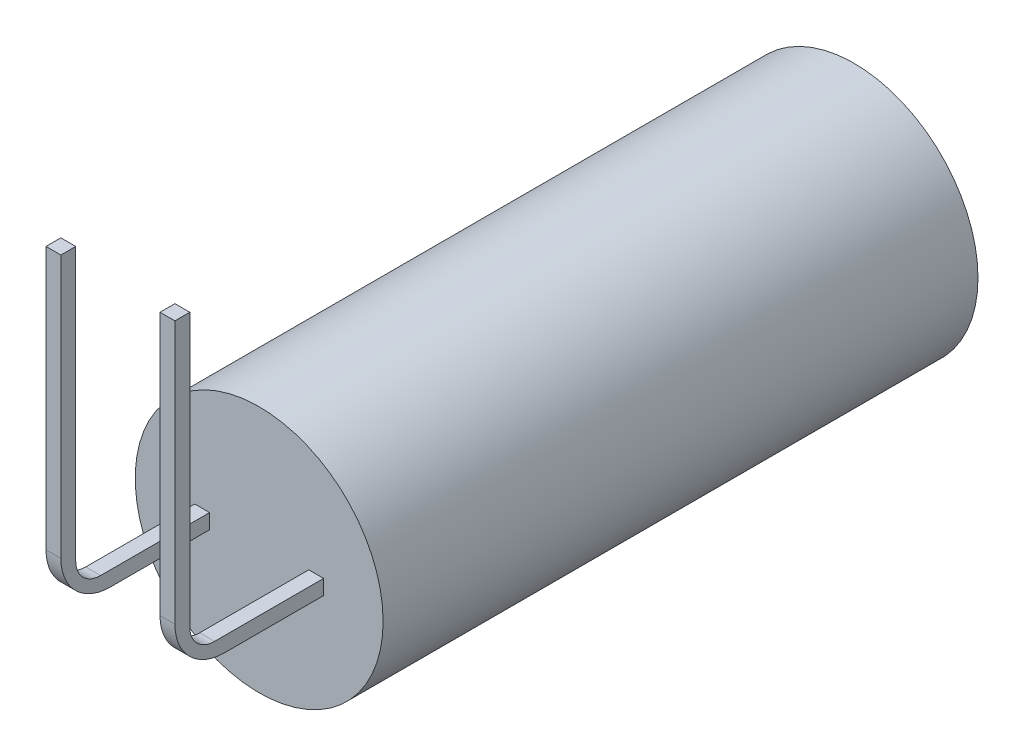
ISO-10303-21;
HEADER;
FILE_DESCRIPTION(('STEP AP214'),'2;1');
FILE_NAME('part.step','',(''),(''),'','','');
FILE_SCHEMA(('AUTOMOTIVE_DESIGN { 1 0 10303 214 1 1 1 1 }'));
ENDSEC;
DATA;
#1=APPLICATION_CONTEXT('core data for automotive mechanical design processes');
#2=APPLICATION_PROTOCOL_DEFINITION('international standard','automotive_design',2000,#1);
#3=PRODUCT_CONTEXT('',#1,'mechanical');
#4=PRODUCT('Part','Part','',(#3));
#5=PRODUCT_RELATED_PRODUCT_CATEGORY('part','',(#4));
#6=PRODUCT_DEFINITION_FORMATION('','',#4);
#7=PRODUCT_DEFINITION_CONTEXT('part definition',#1,'design');
#8=PRODUCT_DEFINITION('design','',#6,#7);
#9=PRODUCT_DEFINITION_SHAPE('','',#8);
#10=(LENGTH_UNIT() NAMED_UNIT(*) SI_UNIT(.MILLI.,.METRE.));
#11=(NAMED_UNIT(*) PLANE_ANGLE_UNIT() SI_UNIT($,.RADIAN.));
#12=(NAMED_UNIT(*) SI_UNIT($,.STERADIAN.) SOLID_ANGLE_UNIT());
#13=UNCERTAINTY_MEASURE_WITH_UNIT(LENGTH_MEASURE(1.E-05),#10,'distance_accuracy_value','');
#14=(GEOMETRIC_REPRESENTATION_CONTEXT(3) GLOBAL_UNCERTAINTY_ASSIGNED_CONTEXT((#13)) GLOBAL_UNIT_ASSIGNED_CONTEXT((#10,
#11,#12)) REPRESENTATION_CONTEXT('',''));
#15=CARTESIAN_POINT('',(0.,0.,0.));
#16=DIRECTION('',(0.,0.,1.));
#17=DIRECTION('',(1.,0.,0.));
#18=AXIS2_PLACEMENT_3D('',#15,#16,#17);
#19=CARTESIAN_POINT('',(1.3,0.15,3.));
#20=DIRECTION('',(0.,-1.,0.));
#21=DIRECTION('',(1.,0.,0.));
#22=AXIS2_PLACEMENT_3D('',#19,#20,#21);
#23=PLANE('',#22);
#24=DIRECTION('',(0.,0.,-1.));
#25=VECTOR('',#24,1.);
#26=CARTESIAN_POINT('',(1.,0.15,3.));
#27=LINE('',#26,#25);
#28=CARTESIAN_POINT('',(1.,0.15,2.2));
#29=VERTEX_POINT('',#28);
#30=CARTESIAN_POINT('',(1.,0.15,0.));
#31=VERTEX_POINT('',#30);
#32=EDGE_CURVE('E209',#29,#31,#27,.T.);
#33=ORIENTED_EDGE('',*,*,#32,.F.);
#34=DIRECTION('',(-1.,0.,0.));
#35=VECTOR('',#34,1.);
#36=CARTESIAN_POINT('',(1.3,0.15,2.2));
#37=LINE('',#36,#35);
#38=CARTESIAN_POINT('',(1.3,0.15,2.2));
#39=VERTEX_POINT('',#38);
#40=EDGE_CURVE('E245',#29,#39,#37,.F.);
#41=ORIENTED_EDGE('',*,*,#40,.T.);
#42=DIRECTION('',(0.,0.,-1.));
#43=VECTOR('',#42,1.);
#44=CARTESIAN_POINT('',(1.3,0.15,3.));
#45=LINE('',#44,#43);
#46=CARTESIAN_POINT('',(1.3,0.15,0.));
#47=VERTEX_POINT('',#46);
#48=EDGE_CURVE('E203',#39,#47,#45,.T.);
#49=ORIENTED_EDGE('',*,*,#48,.T.);
#50=DIRECTION('',(-1.,0.,0.));
#51=VECTOR('',#50,1.);
#52=CARTESIAN_POINT('',(1.3,0.15,0.));
#53=LINE('',#52,#51);
#54=EDGE_CURVE('E191',#47,#31,#53,.T.);
#55=ORIENTED_EDGE('',*,*,#54,.T.);
#56=EDGE_LOOP('',(#33,#41,#49,#55));
#57=FACE_BOUND('',#56,.T.);
#58=ADVANCED_FACE('F31',(#57),#23,.F.);
#59=CARTESIAN_POINT('',(-1.3,0.15,3.));
#60=DIRECTION('',(0.,-1.,0.));
#61=DIRECTION('',(0.,0.,-1.));
#62=AXIS2_PLACEMENT_3D('',#59,#60,#61);
#63=PLANE('',#62);
#64=DIRECTION('',(0.,0.,-1.));
#65=VECTOR('',#64,1.);
#66=CARTESIAN_POINT('',(-1.3,0.15,3.));
#67=LINE('',#66,#65);
#68=CARTESIAN_POINT('',(-1.3,0.15,2.2));
#69=VERTEX_POINT('',#68);
#70=CARTESIAN_POINT('',(-1.3,0.15,0.));
#71=VERTEX_POINT('',#70);
#72=EDGE_CURVE('E228',#69,#71,#67,.T.);
#73=ORIENTED_EDGE('',*,*,#72,.F.);
#74=DIRECTION('',(-1.,0.,0.));
#75=VECTOR('',#74,1.);
#76=CARTESIAN_POINT('',(-1.,0.15,2.2));
#77=LINE('',#76,#75);
#78=CARTESIAN_POINT('',(-1.,0.15,2.2));
#79=VERTEX_POINT('',#78);
#80=EDGE_CURVE('E250',#69,#79,#77,.F.);
#81=ORIENTED_EDGE('',*,*,#80,.T.);
#82=DIRECTION('',(0.,0.,-1.));
#83=VECTOR('',#82,1.);
#84=CARTESIAN_POINT('',(-1.,0.15,3.));
#85=LINE('',#84,#83);
#86=CARTESIAN_POINT('',(-1.,0.15,0.));
#87=VERTEX_POINT('',#86);
#88=EDGE_CURVE('E230',#79,#87,#85,.T.);
#89=ORIENTED_EDGE('',*,*,#88,.T.);
#90=DIRECTION('',(-1.,0.,0.));
#91=VECTOR('',#90,1.);
#92=CARTESIAN_POINT('',(-1.3,0.15,0.));
#93=LINE('',#92,#91);
#94=EDGE_CURVE('E220',#87,#71,#93,.T.);
#95=ORIENTED_EDGE('',*,*,#94,.T.);
#96=EDGE_LOOP('',(#73,#81,#89,#95));
#97=FACE_BOUND('',#96,.T.);
#98=ADVANCED_FACE('F298',(#97),#63,.F.);
#99=CARTESIAN_POINT('',(0.,0.,0.));
#100=DIRECTION('',(0.,0.,1.));
#101=DIRECTION('',(1.,0.,0.));
#102=AXIS2_PLACEMENT_3D('',#99,#100,#101);
#103=PLANE('',#102);
#104=DIRECTION('',(1.,0.,0.));
#105=VECTOR('',#104,1.);
#106=CARTESIAN_POINT('',(-1.3,-0.15,0.));
#107=LINE('',#106,#105);
#108=CARTESIAN_POINT('',(-1.3,-0.15,0.));
#109=VERTEX_POINT('',#108);
#110=CARTESIAN_POINT('',(-1.,-0.15,0.));
#111=VERTEX_POINT('',#110);
#112=EDGE_CURVE('E214',#109,#111,#107,.T.);
#113=ORIENTED_EDGE('',*,*,#112,.F.);
#114=DIRECTION('',(0.,-1.,0.));
#115=VECTOR('',#114,1.);
#116=CARTESIAN_POINT('',(-1.3,0.15,0.));
#117=LINE('',#116,#115);
#118=EDGE_CURVE('E211',#71,#109,#117,.T.);
#119=ORIENTED_EDGE('',*,*,#118,.F.);
#120=ORIENTED_EDGE('',*,*,#94,.F.);
#121=DIRECTION('',(0.,1.,0.));
#122=VECTOR('',#121,1.);
#123=CARTESIAN_POINT('',(-1.,0.15,0.));
#124=LINE('',#123,#122);
#125=EDGE_CURVE('E217',#111,#87,#124,.T.);
#126=ORIENTED_EDGE('',*,*,#125,.F.);
#127=EDGE_LOOP('',(#113,#119,#120,#126));
#128=FACE_BOUND('',#127,.T.);
#129=CARTESIAN_POINT('',(0.,0.,0.));
#130=DIRECTION('',(0.,0.,1.));
#131=DIRECTION('',(1.,0.,0.));
#132=AXIS2_PLACEMENT_3D('',#129,#130,#131);
#133=CIRCLE('',#132,2.5);
#134=CARTESIAN_POINT('',(2.5,0.,0.));
#135=VERTEX_POINT('',#134);
#136=EDGE_CURVE('E236',#135,#135,#133,.T.);
#137=ORIENTED_EDGE('',*,*,#136,.T.);
#138=EDGE_LOOP('',(#137));
#139=FACE_BOUND('',#138,.T.);
#140=DIRECTION('',(0.,-1.,0.));
#141=VECTOR('',#140,1.);
#142=CARTESIAN_POINT('',(1.,0.15,0.));
#143=LINE('',#142,#141);
#144=CARTESIAN_POINT('',(1.,-0.15,0.));
#145=VERTEX_POINT('',#144);
#146=EDGE_CURVE('E194',#31,#145,#143,.T.);
#147=ORIENTED_EDGE('',*,*,#146,.F.);
#148=ORIENTED_EDGE('',*,*,#54,.F.);
#149=DIRECTION('',(0.,1.,0.));
#150=VECTOR('',#149,1.);
#151=CARTESIAN_POINT('',(1.3,0.15,0.));
#152=LINE('',#151,#150);
#153=CARTESIAN_POINT('',(1.3,-0.15,0.));
#154=VERTEX_POINT('',#153);
#155=EDGE_CURVE('E153',#154,#47,#152,.T.);
#156=ORIENTED_EDGE('',*,*,#155,.F.);
#157=DIRECTION('',(1.,0.,0.));
#158=VECTOR('',#157,1.);
#159=CARTESIAN_POINT('',(1.3,-0.15,0.));
#160=LINE('',#159,#158);
#161=EDGE_CURVE('E197',#145,#154,#160,.T.);
#162=ORIENTED_EDGE('',*,*,#161,.F.);
#163=EDGE_LOOP('',(#147,#148,#156,#162));
#164=FACE_BOUND('',#163,.T.);
#165=ADVANCED_FACE('F303',(#128,#139,#164),#103,.T.);
#166=CARTESIAN_POINT('',(0.,0.,-12.));
#167=DIRECTION('',(0.,0.,1.));
#168=DIRECTION('',(1.,0.,0.));
#169=AXIS2_PLACEMENT_3D('',#166,#167,#168);
#170=CYLINDRICAL_SURFACE('',#169,2.5);
#171=CARTESIAN_POINT('',(0.,0.,-12.));
#172=DIRECTION('',(0.,0.,1.));
#173=DIRECTION('',(1.,0.,0.));
#174=AXIS2_PLACEMENT_3D('',#171,#172,#173);
#175=CIRCLE('',#174,2.5);
#176=CARTESIAN_POINT('',(2.5,0.,-12.));
#177=VERTEX_POINT('',#176);
#178=EDGE_CURVE('E239',#177,#177,#175,.T.);
#179=ORIENTED_EDGE('',*,*,#178,.T.);
#180=EDGE_LOOP('',(#179));
#181=FACE_BOUND('',#180,.T.);
#182=ORIENTED_EDGE('',*,*,#136,.F.);
#183=EDGE_LOOP('',(#182));
#184=FACE_BOUND('',#183,.T.);
#185=ADVANCED_FACE('F33',(#181,#184),#170,.T.);
#186=CARTESIAN_POINT('',(0.,0.,-12.));
#187=DIRECTION('',(0.,0.,1.));
#188=DIRECTION('',(1.,0.,0.));
#189=AXIS2_PLACEMENT_3D('',#186,#187,#188);
#190=PLANE('',#189);
#191=ORIENTED_EDGE('',*,*,#178,.F.);
#192=EDGE_LOOP('',(#191));
#193=FACE_BOUND('',#192,.T.);
#194=ADVANCED_FACE('F324',(#193),#190,.F.);
#195=CARTESIAN_POINT('',(-1.3,0.15,3.));
#196=DIRECTION('',(1.,0.,0.));
#197=DIRECTION('',(0.,0.,-1.));
#198=AXIS2_PLACEMENT_3D('',#195,#196,#197);
#199=PLANE('',#198);
#200=DIRECTION('',(0.,0.,-1.));
#201=VECTOR('',#200,1.);
#202=CARTESIAN_POINT('',(-1.3,-0.15,3.));
#203=LINE('',#202,#201);
#204=CARTESIAN_POINT('',(-1.3,-0.15,2.));
#205=VERTEX_POINT('',#204);
#206=EDGE_CURVE('E234',#205,#109,#203,.T.);
#207=ORIENTED_EDGE('',*,*,#206,.F.);
#208=CARTESIAN_POINT('',(-1.3,0.85,2.));
#209=DIRECTION('',(1.,0.,0.));
#210=DIRECTION('',(0.,0.,-1.));
#211=AXIS2_PLACEMENT_3D('',#208,#209,#210);
#212=CIRCLE('',#211,1.);
#213=CARTESIAN_POINT('',(-1.3,0.85,3.));
#214=VERTEX_POINT('',#213);
#215=EDGE_CURVE('E267',#205,#214,#212,.F.);
#216=ORIENTED_EDGE('',*,*,#215,.T.);
#217=DIRECTION('',(0.,-1.,0.));
#218=VECTOR('',#217,1.);
#219=CARTESIAN_POINT('',(-1.3,0.15,3.));
#220=LINE('',#219,#218);
#221=CARTESIAN_POINT('',(-1.3,6.15,3.));
#222=VERTEX_POINT('',#221);
#223=EDGE_CURVE('E223',#222,#214,#220,.T.);
#224=ORIENTED_EDGE('',*,*,#223,.F.);
#225=DIRECTION('',(0.,0.,1.));
#226=VECTOR('',#225,1.);
#227=CARTESIAN_POINT('',(-1.3,6.15,3.));
#228=LINE('',#227,#226);
#229=CARTESIAN_POINT('',(-1.3,6.15,2.7));
#230=VERTEX_POINT('',#229);
#231=EDGE_CURVE('E175',#230,#222,#228,.T.);
#232=ORIENTED_EDGE('',*,*,#231,.F.);
#233=DIRECTION('',(0.,-1.,0.));
#234=VECTOR('',#233,1.);
#235=CARTESIAN_POINT('',(-1.3,6.15,2.7));
#236=LINE('',#235,#234);
#237=CARTESIAN_POINT('',(-1.3,0.65,2.7));
#238=VERTEX_POINT('',#237);
#239=EDGE_CURVE('E185',#230,#238,#236,.T.);
#240=ORIENTED_EDGE('',*,*,#239,.T.);
#241=CARTESIAN_POINT('',(-1.3,0.65,2.2));
#242=DIRECTION('',(1.,0.,0.));
#243=DIRECTION('',(0.,0.,-1.));
#244=AXIS2_PLACEMENT_3D('',#241,#242,#243);
#245=CIRCLE('',#244,0.5);
#246=EDGE_CURVE('E256',#238,#69,#245,.T.);
#247=ORIENTED_EDGE('',*,*,#246,.T.);
#248=ORIENTED_EDGE('',*,*,#72,.T.);
#249=ORIENTED_EDGE('',*,*,#118,.T.);
#250=EDGE_LOOP('',(#207,#216,#224,#232,#240,#247,#248,#249));
#251=FACE_BOUND('',#250,.T.);
#252=ADVANCED_FACE('F320',(#251),#199,.F.);
#253=CARTESIAN_POINT('',(-1.3,-0.15,3.));
#254=DIRECTION('',(0.,1.,0.));
#255=DIRECTION('',(0.,0.,1.));
#256=AXIS2_PLACEMENT_3D('',#253,#254,#255);
#257=PLANE('',#256);
#258=DIRECTION('',(0.,0.,-1.));
#259=VECTOR('',#258,1.);
#260=CARTESIAN_POINT('',(-1.,-0.15,3.));
#261=LINE('',#260,#259);
#262=CARTESIAN_POINT('',(-1.,-0.15,2.));
#263=VERTEX_POINT('',#262);
#264=EDGE_CURVE('E232',#263,#111,#261,.T.);
#265=ORIENTED_EDGE('',*,*,#264,.F.);
#266=DIRECTION('',(1.,0.,0.));
#267=VECTOR('',#266,1.);
#268=CARTESIAN_POINT('',(-1.3,-0.15,2.));
#269=LINE('',#268,#267);
#270=EDGE_CURVE('E265',#263,#205,#269,.F.);
#271=ORIENTED_EDGE('',*,*,#270,.T.);
#272=ORIENTED_EDGE('',*,*,#206,.T.);
#273=ORIENTED_EDGE('',*,*,#112,.T.);
#274=EDGE_LOOP('',(#265,#271,#272,#273));
#275=FACE_BOUND('',#274,.T.);
#276=ADVANCED_FACE('F316',(#275),#257,.F.);
#277=CARTESIAN_POINT('',(-1.,0.15,3.));
#278=DIRECTION('',(-1.,0.,0.));
#279=DIRECTION('',(0.,0.,1.));
#280=AXIS2_PLACEMENT_3D('',#277,#278,#279);
#281=PLANE('',#280);
#282=DIRECTION('',(0.,1.,0.));
#283=VECTOR('',#282,1.);
#284=CARTESIAN_POINT('',(-1.,0.15,3.));
#285=LINE('',#284,#283);
#286=CARTESIAN_POINT('',(-1.,0.85,3.));
#287=VERTEX_POINT('',#286);
#288=CARTESIAN_POINT('',(-1.,6.15,3.));
#289=VERTEX_POINT('',#288);
#290=EDGE_CURVE('E226',#287,#289,#285,.T.);
#291=ORIENTED_EDGE('',*,*,#290,.F.);
#292=CARTESIAN_POINT('',(-1.,0.85,2.));
#293=DIRECTION('',(-1.,0.,0.));
#294=DIRECTION('',(0.,0.,1.));
#295=AXIS2_PLACEMENT_3D('',#292,#293,#294);
#296=CIRCLE('',#295,1.);
#297=EDGE_CURVE('E263',#287,#263,#296,.F.);
#298=ORIENTED_EDGE('',*,*,#297,.T.);
#299=ORIENTED_EDGE('',*,*,#264,.T.);
#300=ORIENTED_EDGE('',*,*,#125,.T.);
#301=ORIENTED_EDGE('',*,*,#88,.F.);
#302=CARTESIAN_POINT('',(-1.,0.65,2.2));
#303=DIRECTION('',(-1.,0.,0.));
#304=DIRECTION('',(0.,0.,1.));
#305=AXIS2_PLACEMENT_3D('',#302,#303,#304);
#306=CIRCLE('',#305,0.5);
#307=CARTESIAN_POINT('',(-1.,0.65,2.7));
#308=VERTEX_POINT('',#307);
#309=EDGE_CURVE('E258',#79,#308,#306,.T.);
#310=ORIENTED_EDGE('',*,*,#309,.T.);
#311=DIRECTION('',(0.,-1.,0.));
#312=VECTOR('',#311,1.);
#313=CARTESIAN_POINT('',(-1.,6.15,2.7));
#314=LINE('',#313,#312);
#315=CARTESIAN_POINT('',(-1.,6.15,2.7));
#316=VERTEX_POINT('',#315);
#317=EDGE_CURVE('E188',#316,#308,#314,.T.);
#318=ORIENTED_EDGE('',*,*,#317,.F.);
#319=DIRECTION('',(0.,0.,-1.));
#320=VECTOR('',#319,1.);
#321=CARTESIAN_POINT('',(-1.,6.15,3.));
#322=LINE('',#321,#320);
#323=EDGE_CURVE('E181',#289,#316,#322,.T.);
#324=ORIENTED_EDGE('',*,*,#323,.F.);
#325=EDGE_LOOP('',(#291,#298,#299,#300,#301,#310,#318,#324));
#326=FACE_BOUND('',#325,.T.);
#327=ADVANCED_FACE('F311',(#326),#281,.F.);
#328=CARTESIAN_POINT('',(-1.3,-0.15,3.));
#329=DIRECTION('',(0.,0.,1.));
#330=DIRECTION('',(1.,0.,0.));
#331=AXIS2_PLACEMENT_3D('',#328,#329,#330);
#332=PLANE('',#331);
#333=ORIENTED_EDGE('',*,*,#223,.T.);
#334=DIRECTION('',(1.,0.,0.));
#335=VECTOR('',#334,1.);
#336=CARTESIAN_POINT('',(-1.,0.85,3.));
#337=LINE('',#336,#335);
#338=EDGE_CURVE('E260',#214,#287,#337,.T.);
#339=ORIENTED_EDGE('',*,*,#338,.T.);
#340=ORIENTED_EDGE('',*,*,#290,.T.);
#341=DIRECTION('',(1.,0.,0.));
#342=VECTOR('',#341,1.);
#343=CARTESIAN_POINT('',(-1.3,6.15,3.));
#344=LINE('',#343,#342);
#345=EDGE_CURVE('E178',#222,#289,#344,.T.);
#346=ORIENTED_EDGE('',*,*,#345,.F.);
#347=EDGE_LOOP('',(#333,#339,#340,#346));
#348=FACE_BOUND('',#347,.T.);
#349=ADVANCED_FACE('F309',(#348),#332,.T.);
#350=CARTESIAN_POINT('',(1.,0.15,3.));
#351=DIRECTION('',(1.,0.,0.));
#352=DIRECTION('',(0.,1.,0.));
#353=AXIS2_PLACEMENT_3D('',#350,#351,#352);
#354=PLANE('',#353);
#355=DIRECTION('',(0.,0.,-1.));
#356=VECTOR('',#355,1.);
#357=CARTESIAN_POINT('',(1.,-0.15,3.));
#358=LINE('',#357,#356);
#359=CARTESIAN_POINT('',(1.,-0.15,2.));
#360=VERTEX_POINT('',#359);
#361=EDGE_CURVE('E207',#360,#145,#358,.T.);
#362=ORIENTED_EDGE('',*,*,#361,.F.);
#363=CARTESIAN_POINT('',(0.999999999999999,0.85,2.));
#364=DIRECTION('',(1.,0.,0.));
#365=DIRECTION('',(0.,1.,0.));
#366=AXIS2_PLACEMENT_3D('',#363,#364,#365);
#367=CIRCLE('',#366,1.);
#368=CARTESIAN_POINT('',(0.999999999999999,0.85,3.));
#369=VERTEX_POINT('',#368);
#370=EDGE_CURVE('E11',#360,#369,#367,.F.);
#371=ORIENTED_EDGE('',*,*,#370,.T.);
#372=DIRECTION('',(0.,-1.,0.));
#373=VECTOR('',#372,1.);
#374=CARTESIAN_POINT('',(1.,0.15,3.));
#375=LINE('',#374,#373);
#376=CARTESIAN_POINT('',(1.,6.15,3.));
#377=VERTEX_POINT('',#376);
#378=EDGE_CURVE('E142',#377,#369,#375,.T.);
#379=ORIENTED_EDGE('',*,*,#378,.F.);
#380=DIRECTION('',(0.,0.,1.));
#381=VECTOR('',#380,1.);
#382=CARTESIAN_POINT('',(1.,6.15,3.));
#383=LINE('',#382,#381);
#384=CARTESIAN_POINT('',(1.,6.15,2.7));
#385=VERTEX_POINT('',#384);
#386=EDGE_CURVE('E147',#385,#377,#383,.T.);
#387=ORIENTED_EDGE('',*,*,#386,.F.);
#388=DIRECTION('',(0.,-1.,0.));
#389=VECTOR('',#388,1.);
#390=CARTESIAN_POINT('',(1.,6.15,2.7));
#391=LINE('',#390,#389);
#392=CARTESIAN_POINT('',(1.,0.65,2.7));
#393=VERTEX_POINT('',#392);
#394=EDGE_CURVE('E170',#385,#393,#391,.T.);
#395=ORIENTED_EDGE('',*,*,#394,.T.);
#396=CARTESIAN_POINT('',(0.999999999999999,0.65,2.2));
#397=DIRECTION('',(1.,0.,0.));
#398=DIRECTION('',(0.,1.,0.));
#399=AXIS2_PLACEMENT_3D('',#396,#397,#398);
#400=CIRCLE('',#399,0.5);
#401=EDGE_CURVE('E252',#393,#29,#400,.T.);
#402=ORIENTED_EDGE('',*,*,#401,.T.);
#403=ORIENTED_EDGE('',*,*,#32,.T.);
#404=ORIENTED_EDGE('',*,*,#146,.T.);
#405=EDGE_LOOP('',(#362,#371,#379,#387,#395,#402,#403,#404));
#406=FACE_BOUND('',#405,.T.);
#407=ADVANCED_FACE('F144',(#406),#354,.F.);
#408=CARTESIAN_POINT('',(1.3,-0.15,3.));
#409=DIRECTION('',(0.,1.,0.));
#410=DIRECTION('',(-1.,0.,0.));
#411=AXIS2_PLACEMENT_3D('',#408,#409,#410);
#412=PLANE('',#411);
#413=DIRECTION('',(0.,0.,-1.));
#414=VECTOR('',#413,1.);
#415=CARTESIAN_POINT('',(1.3,-0.15,3.));
#416=LINE('',#415,#414);
#417=CARTESIAN_POINT('',(1.3,-0.15,2.));
#418=VERTEX_POINT('',#417);
#419=EDGE_CURVE('E205',#418,#154,#416,.T.);
#420=ORIENTED_EDGE('',*,*,#419,.F.);
#421=DIRECTION('',(1.,0.,0.));
#422=VECTOR('',#421,1.);
#423=CARTESIAN_POINT('',(1.,-0.15,2.));
#424=LINE('',#423,#422);
#425=EDGE_CURVE('E39',#418,#360,#424,.F.);
#426=ORIENTED_EDGE('',*,*,#425,.T.);
#427=ORIENTED_EDGE('',*,*,#361,.T.);
#428=ORIENTED_EDGE('',*,*,#161,.T.);
#429=EDGE_LOOP('',(#420,#426,#427,#428));
#430=FACE_BOUND('',#429,.T.);
#431=ADVANCED_FACE('F387',(#430),#412,.F.);
#432=CARTESIAN_POINT('',(1.3,0.15,3.));
#433=DIRECTION('',(-1.,0.,0.));
#434=DIRECTION('',(0.,-1.,0.));
#435=AXIS2_PLACEMENT_3D('',#432,#433,#434);
#436=PLANE('',#435);
#437=DIRECTION('',(0.,1.,0.));
#438=VECTOR('',#437,1.);
#439=CARTESIAN_POINT('',(1.3,0.15,3.));
#440=LINE('',#439,#438);
#441=CARTESIAN_POINT('',(1.3,0.85,3.));
#442=VERTEX_POINT('',#441);
#443=CARTESIAN_POINT('',(1.3,6.15,3.));
#444=VERTEX_POINT('',#443);
#445=EDGE_CURVE('E152',#442,#444,#440,.T.);
#446=ORIENTED_EDGE('',*,*,#445,.F.);
#447=CARTESIAN_POINT('',(1.3,0.85,2.));
#448=DIRECTION('',(-1.,0.,0.));
#449=DIRECTION('',(0.,-1.,0.));
#450=AXIS2_PLACEMENT_3D('',#447,#448,#449);
#451=CIRCLE('',#450,1.);
#452=EDGE_CURVE('E53',#442,#418,#451,.F.);
#453=ORIENTED_EDGE('',*,*,#452,.T.);
#454=ORIENTED_EDGE('',*,*,#419,.T.);
#455=ORIENTED_EDGE('',*,*,#155,.T.);
#456=ORIENTED_EDGE('',*,*,#48,.F.);
#457=CARTESIAN_POINT('',(1.3,0.65,2.2));
#458=DIRECTION('',(-1.,0.,0.));
#459=DIRECTION('',(0.,-1.,0.));
#460=AXIS2_PLACEMENT_3D('',#457,#458,#459);
#461=CIRCLE('',#460,0.5);
#462=CARTESIAN_POINT('',(1.3,0.65,2.7));
#463=VERTEX_POINT('',#462);
#464=EDGE_CURVE('E254',#39,#463,#461,.T.);
#465=ORIENTED_EDGE('',*,*,#464,.T.);
#466=DIRECTION('',(0.,-1.,0.));
#467=VECTOR('',#466,1.);
#468=CARTESIAN_POINT('',(1.3,6.15,2.7));
#469=LINE('',#468,#467);
#470=CARTESIAN_POINT('',(1.3,6.15,2.7));
#471=VERTEX_POINT('',#470);
#472=EDGE_CURVE('E172',#471,#463,#469,.T.);
#473=ORIENTED_EDGE('',*,*,#472,.F.);
#474=DIRECTION('',(0.,0.,-1.));
#475=VECTOR('',#474,1.);
#476=CARTESIAN_POINT('',(1.3,6.15,3.));
#477=LINE('',#476,#475);
#478=EDGE_CURVE('E160',#444,#471,#477,.T.);
#479=ORIENTED_EDGE('',*,*,#478,.F.);
#480=EDGE_LOOP('',(#446,#453,#454,#455,#456,#465,#473,#479));
#481=FACE_BOUND('',#480,.T.);
#482=ADVANCED_FACE('F272',(#481),#436,.F.);
#483=CARTESIAN_POINT('',(1.,0.15,3.));
#484=DIRECTION('',(0.,0.,1.));
#485=DIRECTION('',(1.,0.,0.));
#486=AXIS2_PLACEMENT_3D('',#483,#484,#485);
#487=PLANE('',#486);
#488=ORIENTED_EDGE('',*,*,#378,.T.);
#489=DIRECTION('',(1.,0.,0.));
#490=VECTOR('',#489,1.);
#491=CARTESIAN_POINT('',(1.3,0.85,3.));
#492=LINE('',#491,#490);
#493=EDGE_CURVE('E269',#369,#442,#492,.T.);
#494=ORIENTED_EDGE('',*,*,#493,.T.);
#495=ORIENTED_EDGE('',*,*,#445,.T.);
#496=DIRECTION('',(1.,0.,0.));
#497=VECTOR('',#496,1.);
#498=CARTESIAN_POINT('',(1.,6.15,3.));
#499=LINE('',#498,#497);
#500=EDGE_CURVE('E156',#377,#444,#499,.T.);
#501=ORIENTED_EDGE('',*,*,#500,.F.);
#502=EDGE_LOOP('',(#488,#494,#495,#501));
#503=FACE_BOUND('',#502,.T.);
#504=ADVANCED_FACE('F157',(#503),#487,.T.);
#505=CARTESIAN_POINT('',(-1.3,6.15,2.7));
#506=DIRECTION('',(0.,0.,1.));
#507=DIRECTION('',(1.,0.,0.));
#508=AXIS2_PLACEMENT_3D('',#505,#506,#507);
#509=PLANE('',#508);
#510=ORIENTED_EDGE('',*,*,#317,.T.);
#511=DIRECTION('',(-1.,0.,0.));
#512=VECTOR('',#511,1.);
#513=CARTESIAN_POINT('',(-1.3,0.65,2.7));
#514=LINE('',#513,#512);
#515=EDGE_CURVE('E247',#308,#238,#514,.T.);
#516=ORIENTED_EDGE('',*,*,#515,.T.);
#517=ORIENTED_EDGE('',*,*,#239,.F.);
#518=DIRECTION('',(-1.,0.,0.));
#519=VECTOR('',#518,1.);
#520=CARTESIAN_POINT('',(-1.3,6.15,2.7));
#521=LINE('',#520,#519);
#522=EDGE_CURVE('E183',#316,#230,#521,.T.);
#523=ORIENTED_EDGE('',*,*,#522,.F.);
#524=EDGE_LOOP('',(#510,#516,#517,#523));
#525=FACE_BOUND('',#524,.T.);
#526=ADVANCED_FACE('F365',(#525),#509,.F.);
#527=CARTESIAN_POINT('',(-1.3,6.15,2.7));
#528=DIRECTION('',(0.,-1.,0.));
#529=DIRECTION('',(0.,0.,-1.));
#530=AXIS2_PLACEMENT_3D('',#527,#528,#529);
#531=PLANE('',#530);
#532=ORIENTED_EDGE('',*,*,#231,.T.);
#533=ORIENTED_EDGE('',*,*,#345,.T.);
#534=ORIENTED_EDGE('',*,*,#323,.T.);
#535=ORIENTED_EDGE('',*,*,#522,.T.);
#536=EDGE_LOOP('',(#532,#533,#534,#535));
#537=FACE_BOUND('',#536,.T.);
#538=ADVANCED_FACE('F360',(#537),#531,.F.);
#539=CARTESIAN_POINT('',(1.,6.15,2.7));
#540=DIRECTION('',(0.,0.,1.));
#541=DIRECTION('',(1.,0.,0.));
#542=AXIS2_PLACEMENT_3D('',#539,#540,#541);
#543=PLANE('',#542);
#544=ORIENTED_EDGE('',*,*,#472,.T.);
#545=DIRECTION('',(-1.,0.,0.));
#546=VECTOR('',#545,1.);
#547=CARTESIAN_POINT('',(1.,0.65,2.7));
#548=LINE('',#547,#546);
#549=EDGE_CURVE('E242',#463,#393,#548,.T.);
#550=ORIENTED_EDGE('',*,*,#549,.T.);
#551=ORIENTED_EDGE('',*,*,#394,.F.);
#552=DIRECTION('',(-1.,0.,0.));
#553=VECTOR('',#552,1.);
#554=CARTESIAN_POINT('',(1.,6.15,2.7));
#555=LINE('',#554,#553);
#556=EDGE_CURVE('E164',#471,#385,#555,.T.);
#557=ORIENTED_EDGE('',*,*,#556,.F.);
#558=EDGE_LOOP('',(#544,#550,#551,#557));
#559=FACE_BOUND('',#558,.T.);
#560=ADVANCED_FACE('F278',(#559),#543,.F.);
#561=CARTESIAN_POINT('',(1.,6.15,2.7));
#562=DIRECTION('',(0.,-1.,0.));
#563=DIRECTION('',(0.,0.,-1.));
#564=AXIS2_PLACEMENT_3D('',#561,#562,#563);
#565=PLANE('',#564);
#566=ORIENTED_EDGE('',*,*,#386,.T.);
#567=ORIENTED_EDGE('',*,*,#500,.T.);
#568=ORIENTED_EDGE('',*,*,#478,.T.);
#569=ORIENTED_EDGE('',*,*,#556,.T.);
#570=EDGE_LOOP('',(#566,#567,#568,#569));
#571=FACE_BOUND('',#570,.T.);
#572=ADVANCED_FACE('F162',(#571),#565,.F.);
#573=CARTESIAN_POINT('',(1.,0.65,2.2));
#574=DIRECTION('',(1.,0.,0.));
#575=DIRECTION('',(0.,1.,0.));
#576=AXIS2_PLACEMENT_3D('',#573,#574,#575);
#577=CYLINDRICAL_SURFACE('',#576,0.5);
#578=ORIENTED_EDGE('',*,*,#464,.F.);
#579=ORIENTED_EDGE('',*,*,#40,.F.);
#580=ORIENTED_EDGE('',*,*,#401,.F.);
#581=ORIENTED_EDGE('',*,*,#549,.F.);
#582=EDGE_LOOP('',(#578,#579,#580,#581));
#583=FACE_BOUND('',#582,.T.);
#584=ADVANCED_FACE('F285',(#583),#577,.F.);
#585=CARTESIAN_POINT('',(-1.3,0.65,2.2));
#586=DIRECTION('',(1.,0.,0.));
#587=DIRECTION('',(0.,0.,-1.));
#588=AXIS2_PLACEMENT_3D('',#585,#586,#587);
#589=CYLINDRICAL_SURFACE('',#588,0.5);
#590=ORIENTED_EDGE('',*,*,#309,.F.);
#591=ORIENTED_EDGE('',*,*,#80,.F.);
#592=ORIENTED_EDGE('',*,*,#246,.F.);
#593=ORIENTED_EDGE('',*,*,#515,.F.);
#594=EDGE_LOOP('',(#590,#591,#592,#593));
#595=FACE_BOUND('',#594,.T.);
#596=ADVANCED_FACE('F287',(#595),#589,.F.);
#597=CARTESIAN_POINT('',(-1.3,0.85,2.));
#598=DIRECTION('',(-1.,0.,0.));
#599=DIRECTION('',(0.,0.,1.));
#600=AXIS2_PLACEMENT_3D('',#597,#598,#599);
#601=CYLINDRICAL_SURFACE('',#600,1.);
#602=ORIENTED_EDGE('',*,*,#215,.F.);
#603=ORIENTED_EDGE('',*,*,#270,.F.);
#604=ORIENTED_EDGE('',*,*,#297,.F.);
#605=ORIENTED_EDGE('',*,*,#338,.F.);
#606=EDGE_LOOP('',(#602,#603,#604,#605));
#607=FACE_BOUND('',#606,.T.);
#608=ADVANCED_FACE('F293',(#607),#601,.T.);
#609=CARTESIAN_POINT('',(1.,0.85,2.));
#610=DIRECTION('',(-1.,0.,0.));
#611=DIRECTION('',(0.,-1.,0.));
#612=AXIS2_PLACEMENT_3D('',#609,#610,#611);
#613=CYLINDRICAL_SURFACE('',#612,1.);
#614=ORIENTED_EDGE('',*,*,#370,.F.);
#615=ORIENTED_EDGE('',*,*,#425,.F.);
#616=ORIENTED_EDGE('',*,*,#452,.F.);
#617=ORIENTED_EDGE('',*,*,#493,.F.);
#618=EDGE_LOOP('',(#614,#615,#616,#617));
#619=FACE_BOUND('',#618,.T.);
#620=ADVANCED_FACE('F341',(#619),#613,.T.);
#621=CLOSED_SHELL('',(#58,#98,#165,#185,#194,#252,#276,#327,#349,#407,#431,#482,#504,#526,#538,
#560,#572,#584,#596,#608,#620));
#622=MANIFOLD_SOLID_BREP('B2',#621);
#623=ADVANCED_BREP_SHAPE_REPRESENTATION('',(#18,#622),#14);
#624=SHAPE_DEFINITION_REPRESENTATION(#9,#623);
ENDSEC;
END-ISO-10303-21;
